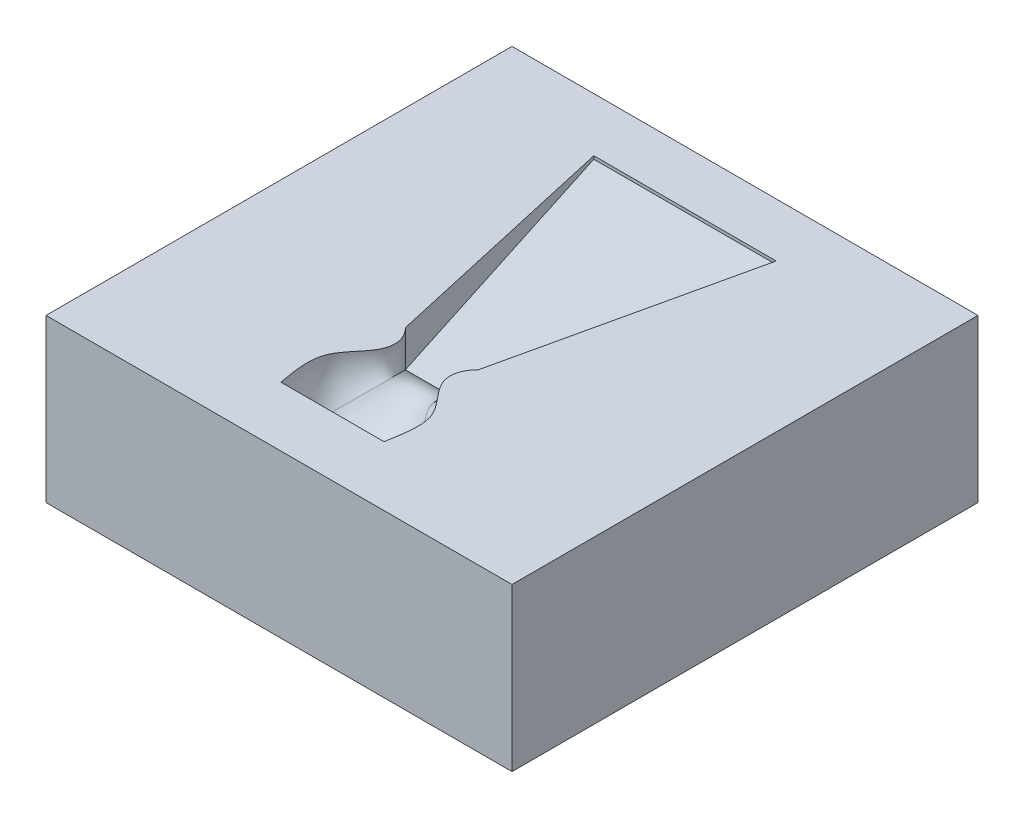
ISO-10303-21;
HEADER;
FILE_DESCRIPTION(('STEP AP214'),'2;1');
FILE_NAME('part.step','',(''),(''),'','','');
FILE_SCHEMA(('AUTOMOTIVE_DESIGN { 1 0 10303 214 1 1 1 1 }'));
ENDSEC;
DATA;
#1=APPLICATION_CONTEXT('core data for automotive mechanical design processes');
#2=APPLICATION_PROTOCOL_DEFINITION('international standard','automotive_design',2000,#1);
#3=PRODUCT_CONTEXT('',#1,'mechanical');
#4=PRODUCT('Part','Part','',(#3));
#5=PRODUCT_RELATED_PRODUCT_CATEGORY('part','',(#4));
#6=PRODUCT_DEFINITION_FORMATION('','',#4);
#7=PRODUCT_DEFINITION_CONTEXT('part definition',#1,'design');
#8=PRODUCT_DEFINITION('design','',#6,#7);
#9=PRODUCT_DEFINITION_SHAPE('','',#8);
#10=(LENGTH_UNIT() NAMED_UNIT(*) SI_UNIT(.MILLI.,.METRE.));
#11=(NAMED_UNIT(*) PLANE_ANGLE_UNIT() SI_UNIT($,.RADIAN.));
#12=(NAMED_UNIT(*) SI_UNIT($,.STERADIAN.) SOLID_ANGLE_UNIT());
#13=UNCERTAINTY_MEASURE_WITH_UNIT(LENGTH_MEASURE(1.E-05),#10,'distance_accuracy_value','');
#14=(GEOMETRIC_REPRESENTATION_CONTEXT(3) GLOBAL_UNCERTAINTY_ASSIGNED_CONTEXT((#13)) GLOBAL_UNIT_ASSIGNED_CONTEXT((#10,
#11,#12)) REPRESENTATION_CONTEXT('',''));
#15=CARTESIAN_POINT('',(0.,0.,0.));
#16=DIRECTION('',(0.,0.,1.));
#17=DIRECTION('',(1.,0.,0.));
#18=AXIS2_PLACEMENT_3D('',#15,#16,#17);
#19=CARTESIAN_POINT('',(0.,40.,0.));
#20=DIRECTION('',(-1.,0.,0.));
#21=DIRECTION('',(0.,0.,1.));
#22=AXIS2_PLACEMENT_3D('',#19,#20,#21);
#23=PLANE('',#22);
#24=DIRECTION('',(0.,0.,-1.));
#25=VECTOR('',#24,1.);
#26=CARTESIAN_POINT('',(0.,0.,0.));
#27=LINE('',#26,#25);
#28=CARTESIAN_POINT('',(0.,0.,0.));
#29=VERTEX_POINT('',#28);
#30=CARTESIAN_POINT('',(0.,0.,-115.));
#31=VERTEX_POINT('',#30);
#32=EDGE_CURVE('E321',#29,#31,#27,.T.);
#33=ORIENTED_EDGE('',*,*,#32,.T.);
#34=DIRECTION('',(0.,-1.,0.));
#35=VECTOR('',#34,1.);
#36=CARTESIAN_POINT('',(0.,40.,-115.));
#37=LINE('',#36,#35);
#38=CARTESIAN_POINT('',(0.,40.,-115.));
#39=VERTEX_POINT('',#38);
#40=EDGE_CURVE('E368',#39,#31,#37,.T.);
#41=ORIENTED_EDGE('',*,*,#40,.F.);
#42=DIRECTION('',(0.,0.,-1.));
#43=VECTOR('',#42,1.);
#44=CARTESIAN_POINT('',(0.,40.,0.));
#45=LINE('',#44,#43);
#46=CARTESIAN_POINT('',(0.,40.,0.));
#47=VERTEX_POINT('',#46);
#48=EDGE_CURVE('E348',#47,#39,#45,.T.);
#49=ORIENTED_EDGE('',*,*,#48,.F.);
#50=DIRECTION('',(0.,-1.,0.));
#51=VECTOR('',#50,1.);
#52=CARTESIAN_POINT('',(0.,40.,0.));
#53=LINE('',#52,#51);
#54=EDGE_CURVE('E354',#47,#29,#53,.T.);
#55=ORIENTED_EDGE('',*,*,#54,.T.);
#56=EDGE_LOOP('',(#33,#41,#49,#55));
#57=FACE_BOUND('',#56,.T.);
#58=ADVANCED_FACE('F37',(#57),#23,.F.);
#59=CARTESIAN_POINT('',(0.,40.,-115.));
#60=DIRECTION('',(0.,0.,1.));
#61=DIRECTION('',(1.,0.,0.));
#62=AXIS2_PLACEMENT_3D('',#59,#60,#61);
#63=PLANE('',#62);
#64=DIRECTION('',(-1.,0.,0.));
#65=VECTOR('',#64,1.);
#66=CARTESIAN_POINT('',(0.,0.,-115.));
#67=LINE('',#66,#65);
#68=CARTESIAN_POINT('',(-115.,0.,-115.));
#69=VERTEX_POINT('',#68);
#70=EDGE_CURVE('E357',#31,#69,#67,.T.);
#71=ORIENTED_EDGE('',*,*,#70,.T.);
#72=DIRECTION('',(0.,-1.,0.));
#73=VECTOR('',#72,1.);
#74=CARTESIAN_POINT('',(-115.,40.,-115.));
#75=LINE('',#74,#73);
#76=CARTESIAN_POINT('',(-115.,40.,-115.));
#77=VERTEX_POINT('',#76);
#78=EDGE_CURVE('E365',#77,#69,#75,.T.);
#79=ORIENTED_EDGE('',*,*,#78,.F.);
#80=DIRECTION('',(-1.,0.,0.));
#81=VECTOR('',#80,1.);
#82=CARTESIAN_POINT('',(0.,40.,-115.));
#83=LINE('',#82,#81);
#84=EDGE_CURVE('E93',#39,#77,#83,.T.);
#85=ORIENTED_EDGE('',*,*,#84,.F.);
#86=ORIENTED_EDGE('',*,*,#40,.T.);
#87=EDGE_LOOP('',(#71,#79,#85,#86));
#88=FACE_BOUND('',#87,.T.);
#89=ADVANCED_FACE('F404',(#88),#63,.F.);
#90=CARTESIAN_POINT('',(-115.,40.,0.));
#91=DIRECTION('',(1.,0.,0.));
#92=DIRECTION('',(0.,0.,-1.));
#93=AXIS2_PLACEMENT_3D('',#90,#91,#92);
#94=PLANE('',#93);
#95=DIRECTION('',(0.,0.,1.));
#96=VECTOR('',#95,1.);
#97=CARTESIAN_POINT('',(-115.,0.,0.));
#98=LINE('',#97,#96);
#99=CARTESIAN_POINT('',(-115.,0.,0.));
#100=VERTEX_POINT('',#99);
#101=EDGE_CURVE('E359',#69,#100,#98,.T.);
#102=ORIENTED_EDGE('',*,*,#101,.T.);
#103=DIRECTION('',(0.,-1.,0.));
#104=VECTOR('',#103,1.);
#105=CARTESIAN_POINT('',(-115.,40.,0.));
#106=LINE('',#105,#104);
#107=CARTESIAN_POINT('',(-115.,40.,0.));
#108=VERTEX_POINT('',#107);
#109=EDGE_CURVE('E363',#108,#100,#106,.T.);
#110=ORIENTED_EDGE('',*,*,#109,.F.);
#111=DIRECTION('',(0.,0.,1.));
#112=VECTOR('',#111,1.);
#113=CARTESIAN_POINT('',(-115.,40.,0.));
#114=LINE('',#113,#112);
#115=EDGE_CURVE('E351',#77,#108,#114,.T.);
#116=ORIENTED_EDGE('',*,*,#115,.F.);
#117=ORIENTED_EDGE('',*,*,#78,.T.);
#118=EDGE_LOOP('',(#102,#110,#116,#117));
#119=FACE_BOUND('',#118,.T.);
#120=ADVANCED_FACE('F409',(#119),#94,.F.);
#121=CARTESIAN_POINT('',(0.,40.,0.));
#122=DIRECTION('',(0.,0.,-1.));
#123=DIRECTION('',(-1.,0.,0.));
#124=AXIS2_PLACEMENT_3D('',#121,#122,#123);
#125=PLANE('',#124);
#126=DIRECTION('',(1.,0.,0.));
#127=VECTOR('',#126,1.);
#128=CARTESIAN_POINT('',(0.,0.,0.));
#129=LINE('',#128,#127);
#130=EDGE_CURVE('E85',#100,#29,#129,.T.);
#131=ORIENTED_EDGE('',*,*,#130,.T.);
#132=ORIENTED_EDGE('',*,*,#54,.F.);
#133=DIRECTION('',(1.,0.,0.));
#134=VECTOR('',#133,1.);
#135=CARTESIAN_POINT('',(0.,40.,0.));
#136=LINE('',#135,#134);
#137=EDGE_CURVE('E64',#108,#47,#136,.T.);
#138=ORIENTED_EDGE('',*,*,#137,.F.);
#139=ORIENTED_EDGE('',*,*,#109,.T.);
#140=EDGE_LOOP('',(#131,#132,#138,#139));
#141=FACE_BOUND('',#140,.T.);
#142=ADVANCED_FACE('F280',(#141),#125,.F.);
#143=CARTESIAN_POINT('',(0.,40.,0.));
#144=DIRECTION('',(0.,1.,0.));
#145=DIRECTION('',(0.,0.,1.));
#146=AXIS2_PLACEMENT_3D('',#143,#144,#145);
#147=PLANE('',#146);
#148=CARTESIAN_POINT('',(-46.3077188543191,40.,-14.7259999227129));
#149=CARTESIAN_POINT('',(-46.2579454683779,40.,-15.0263227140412));
#150=CARTESIAN_POINT('',(-46.2070289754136,40.,-15.3264509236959));
#151=CARTESIAN_POINT('',(-46.1047439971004,40.,-15.926660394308));
#152=CARTESIAN_POINT('',(-46.0533754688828,40.,-16.226741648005));
#153=CARTESIAN_POINT('',(-45.9517613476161,40.,-16.8287388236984));
#154=CARTESIAN_POINT('',(-45.9015231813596,40.,-17.1306560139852));
#155=CARTESIAN_POINT('',(-45.8044134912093,40.,-17.7350280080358));
#156=CARTESIAN_POINT('',(-45.757541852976,40.,-18.0374827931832));
#157=CARTESIAN_POINT('',(-45.6663746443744,40.,-18.6629974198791));
#158=CARTESIAN_POINT('',(-45.6224476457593,40.,-18.9861120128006));
#159=CARTESIAN_POINT('',(-45.5435842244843,40.,-19.633495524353));
#160=CARTESIAN_POINT('',(-45.5086486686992,40.,-19.9577645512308));
#161=CARTESIAN_POINT('',(-45.450990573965,40.,-20.6066894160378));
#162=CARTESIAN_POINT('',(-45.4282406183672,40.,-20.9313427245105));
#163=CARTESIAN_POINT('',(-45.398388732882,40.,-21.58133422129));
#164=CARTESIAN_POINT('',(-45.3912823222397,40.,-21.9066721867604));
#165=CARTESIAN_POINT('',(-45.3968523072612,40.,-22.5792996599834));
#166=CARTESIAN_POINT('',(-45.4109010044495,40.,-22.9265837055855));
#167=CARTESIAN_POINT('',(-45.4666142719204,40.,-23.6193380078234));
#168=CARTESIAN_POINT('',(-45.5082938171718,40.,-23.9648071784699));
#169=CARTESIAN_POINT('',(-45.5947321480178,40.,-24.4752091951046));
#170=CARTESIAN_POINT('',(-45.6270606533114,40.,-24.6422873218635));
#171=CARTESIAN_POINT('',(-45.7000810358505,40.,-24.9746308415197));
#172=CARTESIAN_POINT('',(-45.7407731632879,40.,-25.1398961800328));
#173=CARTESIAN_POINT('',(-45.8309049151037,40.,-25.4678242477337));
#174=CARTESIAN_POINT('',(-45.8803342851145,40.,-25.6304897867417));
#175=CARTESIAN_POINT('',(-45.9882734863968,40.,-25.9527704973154));
#176=CARTESIAN_POINT('',(-46.0467824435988,40.,-26.1123859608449));
#177=CARTESIAN_POINT('',(-46.1734201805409,40.,-26.4288415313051));
#178=CARTESIAN_POINT('',(-46.2416028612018,40.,-26.5856601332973));
#179=CARTESIAN_POINT('',(-46.3872631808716,40.,-26.8949139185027));
#180=CARTESIAN_POINT('',(-46.4647412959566,40.,-27.0473488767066));
#181=CARTESIAN_POINT('',(-46.6274768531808,40.,-27.3481835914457));
#182=CARTESIAN_POINT('',(-46.7127424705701,40.,-27.4965788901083));
#183=CARTESIAN_POINT('',(-46.889603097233,40.,-27.7895389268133));
#184=CARTESIAN_POINT('',(-46.9811984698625,40.,-27.9341034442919));
#185=CARTESIAN_POINT('',(-47.1705624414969,40.,-28.2214970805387));
#186=CARTESIAN_POINT('',(-47.2683897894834,40.,-28.3642872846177));
#187=CARTESIAN_POINT('',(-47.46814804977,40.,-28.6469477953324));
#188=CARTESIAN_POINT('',(-47.5700788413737,40.,-28.7868181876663));
#189=CARTESIAN_POINT('',(-47.8804721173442,40.,-29.2028065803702));
#190=CARTESIAN_POINT('',(-48.093613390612,40.,-29.4754166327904));
#191=CARTESIAN_POINT('',(-48.5030992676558,40.,-29.9875497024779));
#192=CARTESIAN_POINT('',(-48.6988638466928,40.,-30.2275466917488));
#193=CARTESIAN_POINT('',(-49.0909647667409,40.,-30.7070985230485));
#194=CARTESIAN_POINT('',(-49.2873011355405,40.,-30.9466533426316));
#195=CARTESIAN_POINT('',(-49.6757180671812,40.,-31.4279361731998));
#196=CARTESIAN_POINT('',(-49.8678103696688,40.,-31.6696546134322));
#197=CARTESIAN_POINT('',(-50.243702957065,40.,-32.1595077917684));
#198=CARTESIAN_POINT('',(-50.427504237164,40.,-32.4076417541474));
#199=CARTESIAN_POINT('',(-50.7394500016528,40.,-32.8545075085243));
#200=CARTESIAN_POINT('',(-50.8705309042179,40.,-33.0511620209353));
#201=CARTESIAN_POINT('',(-51.0583491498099,40.,-33.3516650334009));
#202=CARTESIAN_POINT('',(-51.1194922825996,40.,-33.4527606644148));
#203=CARTESIAN_POINT('',(-51.2383377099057,40.,-33.6569609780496));
#204=CARTESIAN_POINT('',(-51.2960400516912,40.,-33.7600656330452));
#205=CARTESIAN_POINT('',(-51.4073435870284,40.,-33.9682066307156));
#206=CARTESIAN_POINT('',(-51.4609528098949,40.,-34.0732386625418));
#207=CARTESIAN_POINT('',(-51.5635738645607,40.,-34.2855340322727));
#208=CARTESIAN_POINT('',(-51.6125856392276,40.,-34.3927973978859));
#209=CARTESIAN_POINT('',(-51.7055870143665,40.,-34.6094414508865));
#210=CARTESIAN_POINT('',(-51.749578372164,40.,-34.7188213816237));
#211=CARTESIAN_POINT('',(-51.8321719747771,40.,-34.9395869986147));
#212=CARTESIAN_POINT('',(-51.8707746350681,40.,-35.0509725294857));
#213=CARTESIAN_POINT('',(-51.9570252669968,40.,-35.3222271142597));
#214=CARTESIAN_POINT('',(-52.0017775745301,40.,-35.4830313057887));
#215=CARTESIAN_POINT('',(-52.078596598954,40.,-35.8076401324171));
#216=CARTESIAN_POINT('',(-52.1106644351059,40.,-35.9714445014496));
#217=CARTESIAN_POINT('',(-52.1611387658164,40.,-36.3011562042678));
#218=CARTESIAN_POINT('',(-52.1795461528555,40.,-36.4670633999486));
#219=CARTESIAN_POINT('',(-52.2019428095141,40.,-36.7998597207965));
#220=CARTESIAN_POINT('',(-52.2059323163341,40.,-36.9667488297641));
#221=CARTESIAN_POINT('',(-52.1990517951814,40.,-37.3008582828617));
#222=CARTESIAN_POINT('',(-52.1881257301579,40.,-37.4680775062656));
#223=CARTESIAN_POINT('',(-52.1512911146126,40.,-37.8008542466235));
#224=CARTESIAN_POINT('',(-52.1253826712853,40.,-37.9664117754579));
#225=CARTESIAN_POINT('',(-52.0589777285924,40.,-38.2946073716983));
#226=CARTESIAN_POINT('',(-52.0184777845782,40.,-38.4572447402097));
#227=CARTESIAN_POINT('',(-51.9236772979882,40.,-38.7784334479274));
#228=CARTESIAN_POINT('',(-51.8693755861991,40.,-38.9369844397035));
#229=CARTESIAN_POINT('',(-51.7367573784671,40.,-39.278089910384));
#230=CARTESIAN_POINT('',(-51.6558546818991,40.,-39.4596413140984));
#231=CARTESIAN_POINT('',(-51.4781994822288,40.,-39.8147660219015));
#232=CARTESIAN_POINT('',(-51.3814423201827,40.,-39.9883369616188));
#233=CARTESIAN_POINT('',(-51.0702677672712,40.,-40.4967967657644));
#234=CARTESIAN_POINT('',(-50.8350550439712,40.,-40.8191688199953));
#235=CARTESIAN_POINT('',(-50.4932171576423,40.,-41.2286754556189));
#236=CARTESIAN_POINT('',(-50.4038224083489,40.,-41.3310183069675));
#237=CARTESIAN_POINT('',(-50.2212751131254,40.,-41.531480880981));
#238=CARTESIAN_POINT('',(-50.1281407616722,40.,-41.6296171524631));
#239=CARTESIAN_POINT('',(-50.0331451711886,40.,-41.7259999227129));
#240=B_SPLINE_CURVE_WITH_KNOTS('',3,(#148,#149,#150,#151,#152,#153,#154,#155,#156,#157,#158,
#159,#160,#161,#162,#163,#164,#165,#166,#167,#168,#169,#170,#171,#172,#173,#174,#175,#176,#177,
#178,#179,#180,#181,#182,#183,#184,#185,#186,#187,#188,#189,#190,#191,#192,#193,#194,#195,#196,
#197,#198,#199,#200,#201,#202,#203,#204,#205,#206,#207,#208,#209,#210,#211,#212,#213,#214,#215,
#216,#217,#218,#219,#220,#221,#222,#223,#224,#225,#226,#227,#228,#229,#230,#231,#232,#233,#234,
#235,#236,#237,#238,#239),.UNSPECIFIED.,.F.,.F.,(4,2,2,2,2,2,2,2,2,2,2,2,2,2,2,2,2,2,2,2,2,2,2,
2,2,2,2,2,2,2,2,2,2,2,2,2,2,2,2,2,2,2,2,2,2,4),(0.,0.913250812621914,1.82658918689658,
2.74478593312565,3.66295147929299,4.6411249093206,5.61939261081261,6.5954499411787,
7.5712276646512,8.61308599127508,9.65550943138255,10.1658622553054,10.676230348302,
11.1860033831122,11.6957273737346,12.2084119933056,12.721122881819,13.2343783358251,
13.747663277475,14.2668346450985,14.7859907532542,15.8238871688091,16.7530352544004,
17.6822292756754,18.6084090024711,19.5344772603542,20.2431457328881,20.597532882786,
20.9519151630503,21.3055833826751,21.6592559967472,22.0128044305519,22.3663255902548,
22.8665753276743,23.366780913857,23.8669538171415,24.3671184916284,24.8691674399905,
25.3712127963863,25.873376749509,26.3755832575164,26.9709482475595,27.5664885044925,
28.7584133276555,29.1660358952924,29.5718712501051),.UNSPECIFIED.);
#241=CARTESIAN_POINT('',(-46.3064709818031,39.9999999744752,-14.7259999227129));
#242=VERTEX_POINT('',#241);
#243=CARTESIAN_POINT('',(-50.0331451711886,40.,-41.7259999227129));
#244=VERTEX_POINT('',#243);
#245=EDGE_CURVE('E11',#242,#244,#240,.T.);
#246=ORIENTED_EDGE('',*,*,#245,.F.);
#247=DIRECTION('',(1.,0.,0.));
#248=VECTOR('',#247,1.);
#249=CARTESIAN_POINT('',(0.,40.,-14.7259999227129));
#250=LINE('',#249,#248);
#251=CARTESIAN_POINT('',(-71.7598193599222,40.0000000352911,-14.7259999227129));
#252=VERTEX_POINT('',#251);
#253=EDGE_CURVE('E273',#252,#242,#250,.T.);
#254=ORIENTED_EDGE('',*,*,#253,.F.);
#255=CARTESIAN_POINT('',(-68.0331451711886,40.,-41.7259999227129));
#256=CARTESIAN_POINT('',(-67.9173955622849,40.,-41.608570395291));
#257=CARTESIAN_POINT('',(-67.8043301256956,40.,-41.4884321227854));
#258=CARTESIAN_POINT('',(-67.5840417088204,40.,-41.2420518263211));
#259=CARTESIAN_POINT('',(-67.4768440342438,40.,-41.1157872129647));
#260=CARTESIAN_POINT('',(-67.2695722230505,40.,-40.8572361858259));
#261=CARTESIAN_POINT('',(-67.1695077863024,40.,-40.7249419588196));
#262=CARTESIAN_POINT('',(-66.9769628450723,40.,-40.453308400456));
#263=CARTESIAN_POINT('',(-66.884550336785,40.,-40.3139206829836));
#264=CARTESIAN_POINT('',(-66.7095329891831,40.,-40.0293347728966));
#265=CARTESIAN_POINT('',(-66.6269159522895,40.,-39.884144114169));
#266=CARTESIAN_POINT('',(-66.4726815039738,40.,-39.588170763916));
#267=CARTESIAN_POINT('',(-66.4010543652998,40.,-39.4373931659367));
#268=CARTESIAN_POINT('',(-66.2716770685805,40.,-39.1346496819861));
#269=CARTESIAN_POINT('',(-66.2136119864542,40.,-38.9828188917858));
#270=CARTESIAN_POINT('',(-66.1100520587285,40.,-38.6749051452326));
#271=CARTESIAN_POINT('',(-66.0645575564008,40.,-38.5188220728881));
#272=CARTESIAN_POINT('',(-65.9871630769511,40.,-38.2040621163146));
#273=CARTESIAN_POINT('',(-65.9552022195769,40.,-38.045400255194));
#274=CARTESIAN_POINT('',(-65.9051161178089,40.,-37.7259052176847));
#275=CARTESIAN_POINT('',(-65.8869906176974,40.,-37.5650720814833));
#276=CARTESIAN_POINT('',(-65.8647341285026,40.,-37.2421266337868));
#277=CARTESIAN_POINT('',(-65.8606305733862,40.,-37.0800124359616));
#278=CARTESIAN_POINT('',(-65.8663013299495,40.,-36.756039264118));
#279=CARTESIAN_POINT('',(-65.8760755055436,40.,-36.5941802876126));
#280=CARTESIAN_POINT('',(-65.9090001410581,40.,-36.2715748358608));
#281=CARTESIAN_POINT('',(-65.9321724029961,40.,-36.110830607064));
#282=CARTESIAN_POINT('',(-65.9911204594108,40.,-35.7916582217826));
#283=CARTESIAN_POINT('',(-66.0268992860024,40.,-35.633230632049));
#284=CARTESIAN_POINT('',(-66.1240715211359,40.,-35.2668667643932));
#285=CARTESIAN_POINT('',(-66.1900308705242,40.,-35.0601362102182));
#286=CARTESIAN_POINT('',(-66.3402751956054,40.,-34.6534732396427));
#287=CARTESIAN_POINT('',(-66.4245644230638,40.,-34.4535424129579));
#288=CARTESIAN_POINT('',(-66.6091268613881,40.,-34.0611641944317));
#289=CARTESIAN_POINT('',(-66.7094073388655,40.,-33.8687202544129));
#290=CARTESIAN_POINT('',(-66.9222652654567,40.,-33.4908300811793));
#291=CARTESIAN_POINT('',(-67.034843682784,40.,-33.3053844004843));
#292=CARTESIAN_POINT('',(-67.2426166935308,40.,-32.9818486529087));
#293=CARTESIAN_POINT('',(-67.3359628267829,40.,-32.8425576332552));
#294=CARTESIAN_POINT('',(-67.5269936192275,40.,-32.5669737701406));
#295=CARTESIAN_POINT('',(-67.6246786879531,40.,-32.4306812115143));
#296=CARTESIAN_POINT('',(-67.922705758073,40.,-32.0254047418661));
#297=CARTESIAN_POINT('',(-68.1279866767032,40.,-31.7600717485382));
#298=CARTESIAN_POINT('',(-68.5463810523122,40.,-31.2328966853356));
#299=CARTESIAN_POINT('',(-68.7595374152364,40.,-30.9710894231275));
#300=CARTESIAN_POINT('',(-69.1868699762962,40.,-30.448240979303));
#301=CARTESIAN_POINT('',(-69.4010463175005,40.,-30.1871999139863));
#302=CARTESIAN_POINT('',(-69.7506947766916,40.,-29.7537340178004));
#303=CARTESIAN_POINT('',(-69.887428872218,40.,-29.5823343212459));
#304=CARTESIAN_POINT('',(-70.1574865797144,40.,-29.2368610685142));
#305=CARTESIAN_POINT('',(-70.2908102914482,40.,-29.0627875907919));
#306=CARTESIAN_POINT('',(-70.5522630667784,40.,-28.710838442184));
#307=CARTESIAN_POINT('',(-70.6803937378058,40.,-28.5329639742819));
#308=CARTESIAN_POINT('',(-70.9295107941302,40.,-28.1721670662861));
#309=CARTESIAN_POINT('',(-71.0504949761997,40.,-27.9892430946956));
#310=CARTESIAN_POINT('',(-71.281045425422,40.,-27.6202546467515));
#311=CARTESIAN_POINT('',(-71.3907614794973,40.,-27.4342849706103));
#312=CARTESIAN_POINT('',(-71.5463084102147,40.,-27.1503776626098));
#313=CARTESIAN_POINT('',(-71.5966565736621,40.,-27.0549084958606));
#314=CARTESIAN_POINT('',(-71.6939439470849,40.,-26.862251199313));
#315=CARTESIAN_POINT('',(-71.7408832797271,40.,-26.765063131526));
#316=CARTESIAN_POINT('',(-71.8760113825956,40.,-26.471079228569));
#317=CARTESIAN_POINT('',(-71.9586122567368,40.,-26.2716800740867));
#318=CARTESIAN_POINT('',(-72.1089411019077,40.,-25.8675557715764));
#319=CARTESIAN_POINT('',(-72.1766789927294,40.,-25.6628342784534));
#320=CARTESIAN_POINT('',(-72.3070957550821,40.,-25.2176286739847));
#321=CARTESIAN_POINT('',(-72.3674240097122,40.,-24.9764557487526));
#322=CARTESIAN_POINT('',(-72.4704506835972,40.,-24.4901270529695));
#323=CARTESIAN_POINT('',(-72.5131277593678,40.,-24.2449668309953));
#324=CARTESIAN_POINT('',(-72.5824968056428,40.,-23.7523392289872));
#325=CARTESIAN_POINT('',(-72.6091825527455,40.,-23.5048709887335));
#326=CARTESIAN_POINT('',(-72.6489332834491,40.,-23.0027708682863));
#327=CARTESIAN_POINT('',(-72.661648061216,40.,-22.7481121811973));
#328=CARTESIAN_POINT('',(-72.6743413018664,40.,-22.2386784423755));
#329=CARTESIAN_POINT('',(-72.6743280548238,40.,-21.9839035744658));
#330=CARTESIAN_POINT('',(-72.6635600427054,40.,-21.4746622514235));
#331=CARTESIAN_POINT('',(-72.6528075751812,40.,-21.2201957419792));
#332=CARTESIAN_POINT('',(-72.6214779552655,40.,-20.6965772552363));
#333=CARTESIAN_POINT('',(-72.6003505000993,40.,-20.4274593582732));
#334=CARTESIAN_POINT('',(-72.550052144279,40.,-19.8899515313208));
#335=CARTESIAN_POINT('',(-72.520879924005,40.,-19.6215617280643));
#336=CARTESIAN_POINT('',(-72.4562549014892,40.,-19.0854050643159));
#337=CARTESIAN_POINT('',(-72.4207987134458,40.,-18.8176386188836));
#338=CARTESIAN_POINT('',(-72.3452127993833,40.,-18.2826459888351));
#339=CARTESIAN_POINT('',(-72.305080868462,40.,-18.0154201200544));
#340=CARTESIAN_POINT('',(-72.2238833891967,40.,-17.4958398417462));
#341=CARTESIAN_POINT('',(-72.1829843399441,40.,-17.2434591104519));
#342=CARTESIAN_POINT('',(-72.0995277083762,40.,-16.7390768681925));
#343=CARTESIAN_POINT('',(-72.0569707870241,40.,-16.4870752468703));
#344=CARTESIAN_POINT('',(-71.9713427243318,40.,-15.9834208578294));
#345=CARTESIAN_POINT('',(-71.9282721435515,40.,-15.7317679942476));
#346=CARTESIAN_POINT('',(-71.8427258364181,40.,-15.2287885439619));
#347=CARTESIAN_POINT('',(-71.80024924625,40.,-14.9774621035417));
#348=CARTESIAN_POINT('',(-71.7585714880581,40.,-14.7259999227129));
#349=B_SPLINE_CURVE_WITH_KNOTS('',3,(#255,#256,#257,#258,#259,#260,#261,#262,#263,#264,#265,
#266,#267,#268,#269,#270,#271,#272,#273,#274,#275,#276,#277,#278,#279,#280,#281,#282,#283,#284,
#285,#286,#287,#288,#289,#290,#291,#292,#293,#294,#295,#296,#297,#298,#299,#300,#301,#302,#303,
#304,#305,#306,#307,#308,#309,#310,#311,#312,#313,#314,#315,#316,#317,#318,#319,#320,#321,#322,
#323,#324,#325,#326,#327,#328,#329,#330,#331,#332,#333,#334,#335,#336,#337,#338,#339,#340,#341,
#342,#343,#344,#345,#346,#347,#348),.UNSPECIFIED.,.F.,.F.,(4,2,2,2,2,2,2,2,2,2,2,2,2,2,2,2,2,2,
2,2,2,2,2,2,2,2,2,2,2,2,2,2,2,2,2,2,2,2,2,2,2,2,2,2,2,2,4),(0.,0.494683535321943,
0.991355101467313,1.48868965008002,1.99005266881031,2.49078467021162,2.99107088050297,
3.47822413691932,3.96539069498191,4.45034186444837,4.93528407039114,5.42117452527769,
5.90706021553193,6.39373879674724,6.88053451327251,7.53050642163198,8.18062925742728,
8.83104836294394,9.48151871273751,9.98445706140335,10.4874429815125,11.4935934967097,
12.5064147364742,13.5193824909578,14.17713162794,14.8348615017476,15.4923862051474,
16.1501125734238,16.7974826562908,17.121220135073,17.4449459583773,18.0917691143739,
18.7381592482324,19.4832190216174,20.2291770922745,20.97542528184,21.7399804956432,
22.5040377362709,23.2679315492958,24.0776169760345,24.8874352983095,25.6976912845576,
26.5083309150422,27.2753410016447,28.0420483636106,28.8079841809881,29.5726569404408),.UNSPECIFIED.);
#350=CARTESIAN_POINT('',(-68.0331451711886,40.,-41.7259999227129));
#351=VERTEX_POINT('',#350);
#352=EDGE_CURVE('E271',#351,#252,#349,.T.);
#353=ORIENTED_EDGE('',*,*,#352,.F.);
#354=DIRECTION('',(-0.219512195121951,0.,-0.975609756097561));
#355=VECTOR('',#354,1.);
#356=CARTESIAN_POINT('',(-55.8189603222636,40.,12.5592660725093));
#357=LINE('',#356,#355);
#358=CARTESIAN_POINT('',(-81.5331451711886,40.,-101.725999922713));
#359=VERTEX_POINT('',#358);
#360=EDGE_CURVE('E370',#351,#359,#357,.T.);
#361=ORIENTED_EDGE('',*,*,#360,.T.);
#362=DIRECTION('',(1.,0.,0.));
#363=VECTOR('',#362,1.);
#364=CARTESIAN_POINT('',(0.,40.,-101.725999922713));
#365=LINE('',#364,#363);
#366=CARTESIAN_POINT('',(-36.5331451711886,40.,-101.725999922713));
#367=VERTEX_POINT('',#366);
#368=EDGE_CURVE('E373',#359,#367,#365,.T.);
#369=ORIENTED_EDGE('',*,*,#368,.T.);
#370=DIRECTION('',(-0.219512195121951,0.,0.975609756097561));
#371=VECTOR('',#370,1.);
#372=CARTESIAN_POINT('',(-56.5582345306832,40.,-12.7256027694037));
#373=LINE('',#372,#371);
#374=EDGE_CURVE('E46',#367,#244,#373,.T.);
#375=ORIENTED_EDGE('',*,*,#374,.T.);
#376=EDGE_LOOP('',(#246,#254,#353,#361,#369,#375));
#377=FACE_BOUND('',#376,.T.);
#378=ORIENTED_EDGE('',*,*,#48,.T.);
#379=ORIENTED_EDGE('',*,*,#84,.T.);
#380=ORIENTED_EDGE('',*,*,#115,.T.);
#381=ORIENTED_EDGE('',*,*,#137,.T.);
#382=EDGE_LOOP('',(#378,#379,#380,#381));
#383=FACE_BOUND('',#382,.T.);
#384=ADVANCED_FACE('F275',(#377,#383),#147,.T.);
#385=CARTESIAN_POINT('',(0.,0.,0.));
#386=DIRECTION('',(0.,1.,0.));
#387=DIRECTION('',(0.,0.,1.));
#388=AXIS2_PLACEMENT_3D('',#385,#386,#387);
#389=PLANE('',#388);
#390=ORIENTED_EDGE('',*,*,#32,.F.);
#391=ORIENTED_EDGE('',*,*,#130,.F.);
#392=ORIENTED_EDGE('',*,*,#101,.F.);
#393=ORIENTED_EDGE('',*,*,#70,.F.);
#394=EDGE_LOOP('',(#390,#391,#392,#393));
#395=FACE_BOUND('',#394,.T.);
#396=ADVANCED_FACE('F279',(#395),#389,.F.);
#397=CARTESIAN_POINT('',(-59.0331451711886,39.999946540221,-14.7259999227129));
#398=DIRECTION('',(0.,0.,1.));
#399=DIRECTION('',(1.,0.,0.));
#400=AXIS2_PLACEMENT_3D('',#397,#398,#399);
#401=PLANE('',#400);
#402=ORIENTED_EDGE('',*,*,#253,.T.);
#403=CARTESIAN_POINT('',(-59.0331451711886,39.999946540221,-14.7259999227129));
#404=DIRECTION('',(0.,0.,1.));
#405=DIRECTION('',(1.,0.,0.));
#406=AXIS2_PLACEMENT_3D('',#403,#404,#405);
#407=CIRCLE('',#406,12.7279220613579);
#408=CARTESIAN_POINT('',(-50.0331451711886,30.999946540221,-14.7259999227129));
#409=VERTEX_POINT('',#408);
#410=EDGE_CURVE('E212',#409,#242,#407,.T.);
#411=ORIENTED_EDGE('',*,*,#410,.F.);
#412=CARTESIAN_POINT('',(-68.0331451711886,30.999946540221,-14.7259999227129));
#413=VERTEX_POINT('',#412);
#414=EDGE_CURVE('E319',#413,#409,#407,.T.);
#415=ORIENTED_EDGE('',*,*,#414,.F.);
#416=EDGE_CURVE('E206',#252,#413,#407,.T.);
#417=ORIENTED_EDGE('',*,*,#416,.F.);
#418=EDGE_LOOP('',(#402,#411,#415,#417));
#419=FACE_BOUND('',#418,.T.);
#420=ADVANCED_FACE('F254',(#419),#401,.F.);
#421=CARTESIAN_POINT('',(-50.0331451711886,30.999946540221,-41.7259999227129));
#422=CARTESIAN_POINT('',(-52.4976112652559,33.4644126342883,-39.2259999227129));
#423=CARTESIAN_POINT('',(-55.5987213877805,36.5655227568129,-33.7207224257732));
#424=CARTESIAN_POINT('',(-48.056823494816,29.0236248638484,-26.4389757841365));
#425=CARTESIAN_POINT('',(-49.3256970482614,30.2924984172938,-18.9942279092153));
#426=CARTESIAN_POINT('',(-50.0331451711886,30.999946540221,-14.7259999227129));
#427=CARTESIAN_POINT('',(-50.0331451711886,36.999946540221,-41.7259999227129));
#428=CARTESIAN_POINT('',(-52.4976112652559,37.8214352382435,-39.2259999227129));
#429=CARTESIAN_POINT('',(-51.9140465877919,38.089037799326,-33.7207224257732));
#430=CARTESIAN_POINT('',(-42.5818156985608,35.2028339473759,-26.4389757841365));
#431=CARTESIAN_POINT('',(-44.3584619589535,35.7313655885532,-18.9942279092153));
#432=CARTESIAN_POINT('',(-45.0659100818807,35.9671816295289,-14.7259999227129));
#433=CARTESIAN_POINT('',(-50.0331451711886,42.999946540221,-41.7259999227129));
#434=CARTESIAN_POINT('',(-52.4976112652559,42.1784578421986,-39.2259999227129));
#435=CARTESIAN_POINT('',(-51.9140465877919,41.9108552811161,-33.7207224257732));
#436=CARTESIAN_POINT('',(-42.5818156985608,44.7970591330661,-26.4389757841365));
#437=CARTESIAN_POINT('',(-44.3584619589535,44.2685274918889,-18.9942279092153));
#438=CARTESIAN_POINT('',(-45.0659100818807,44.0327114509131,-14.7259999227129));
#439=CARTESIAN_POINT('',(-50.0331451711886,48.999946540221,-41.7259999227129));
#440=CARTESIAN_POINT('',(-52.4976112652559,46.5354804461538,-39.2259999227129));
#441=CARTESIAN_POINT('',(-55.5987213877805,43.4343703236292,-33.7207224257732));
#442=CARTESIAN_POINT('',(-48.056823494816,50.9762682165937,-26.4389757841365));
#443=CARTESIAN_POINT('',(-49.3256970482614,49.7073946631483,-18.9942279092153));
#444=CARTESIAN_POINT('',(-50.0331451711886,48.999946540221,-14.7259999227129));
#445=B_SPLINE_SURFACE_WITH_KNOTS('',3,3,((#421,#422,#423,#424,#425,#426),(#427,#428,#429,#430,
#431,#432),(#433,#434,#435,#436,#437,#438),(#439,#440,#441,#442,#443,#444)),.UNSPECIFIED.,.F.,
.F.,.F.,(4,4),(4,1,1,4),(0.,1.),(0.,0.284226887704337,0.593739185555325,1.),.UNSPECIFIED.);
#446=DIRECTION('',(0.,1.,0.));
#447=VECTOR('',#446,1.);
#448=CARTESIAN_POINT('',(-50.0331451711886,48.999946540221,-41.7259999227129));
#449=LINE('',#448,#447);
#450=CARTESIAN_POINT('',(-50.0331451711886,30.999946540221,-41.7259999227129));
#451=VERTEX_POINT('',#450);
#452=EDGE_CURVE('E139',#451,#244,#449,.T.);
#453=CARTESIAN_POINT('',(-50.0331451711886,30.999946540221,-41.7259999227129));
#454=CARTESIAN_POINT('',(-52.4976112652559,33.4644126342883,-39.2259999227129));
#455=CARTESIAN_POINT('',(-55.5987213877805,36.5655227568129,-33.7207224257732));
#456=CARTESIAN_POINT('',(-48.056823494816,29.0236248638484,-26.4389757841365));
#457=CARTESIAN_POINT('',(-49.3256970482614,30.2924984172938,-18.9942279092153));
#458=CARTESIAN_POINT('',(-50.0331451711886,30.999946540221,-14.7259999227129));
#459=B_SPLINE_CURVE_WITH_KNOTS('',3,(#453,#454,#455,#456,#457,#458),.UNSPECIFIED.,.F.,.F.,(4,1,
1,4),(0.,0.284226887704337,0.593739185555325,1.),.UNSPECIFIED.);
#460=EDGE_CURVE('E210',#409,#451,#459,.F.);
#461=ORIENTED_EDGE('',*,*,#245,.T.);
#462=ORIENTED_EDGE('',*,*,#452,.F.);
#463=ORIENTED_EDGE('',*,*,#460,.F.);
#464=ORIENTED_EDGE('',*,*,#410,.T.);
#465=EDGE_LOOP('',(#461,#462,#463,#464));
#466=FACE_BOUND('',#465,.T.);
#467=ADVANCED_FACE('F181',(#466),#445,.F.);
#468=CARTESIAN_POINT('',(-68.0331451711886,30.999946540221,-41.7259999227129));
#469=CARTESIAN_POINT('',(-65.5686790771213,33.4644126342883,-39.2259999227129));
#470=CARTESIAN_POINT('',(-62.4675689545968,36.5655227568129,-33.7207224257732));
#471=CARTESIAN_POINT('',(-70.0094668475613,29.0236248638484,-26.4389757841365));
#472=CARTESIAN_POINT('',(-68.7405932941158,30.2924984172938,-18.9942279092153));
#473=CARTESIAN_POINT('',(-68.0331451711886,30.999946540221,-14.7259999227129));
#474=CARTESIAN_POINT('',(-62.0331451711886,30.999946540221,-41.7259999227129));
#475=CARTESIAN_POINT('',(-61.2116564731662,33.4644126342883,-39.2259999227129));
#476=CARTESIAN_POINT('',(-60.9440539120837,32.8808479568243,-33.7207224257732));
#477=CARTESIAN_POINT('',(-63.8302577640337,23.5486170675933,-26.4389757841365));
#478=CARTESIAN_POINT('',(-63.3017261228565,25.3252633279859,-18.9942279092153));
#479=CARTESIAN_POINT('',(-63.0659100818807,26.0327114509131,-14.7259999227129));
#480=CARTESIAN_POINT('',(-56.0331451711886,30.999946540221,-41.7259999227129));
#481=CARTESIAN_POINT('',(-56.854633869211,33.4644126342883,-39.2259999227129));
#482=CARTESIAN_POINT('',(-57.1222364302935,32.8808479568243,-33.7207224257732));
#483=CARTESIAN_POINT('',(-54.2360325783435,23.5486170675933,-26.4389757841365));
#484=CARTESIAN_POINT('',(-54.7645642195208,25.3252633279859,-18.9942279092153));
#485=CARTESIAN_POINT('',(-55.0003802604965,26.0327114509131,-14.7259999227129));
#486=CARTESIAN_POINT('',(-50.0331451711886,30.999946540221,-41.7259999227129));
#487=CARTESIAN_POINT('',(-52.4976112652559,33.4644126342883,-39.2259999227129));
#488=CARTESIAN_POINT('',(-55.5987213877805,36.5655227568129,-33.7207224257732));
#489=CARTESIAN_POINT('',(-48.056823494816,29.0236248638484,-26.4389757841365));
#490=CARTESIAN_POINT('',(-49.3256970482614,30.2924984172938,-18.9942279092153));
#491=CARTESIAN_POINT('',(-50.0331451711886,30.999946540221,-14.7259999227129));
#492=B_SPLINE_SURFACE_WITH_KNOTS('',3,3,((#468,#469,#470,#471,#472,#473),(#474,#475,#476,#477,
#478,#479),(#480,#481,#482,#483,#484,#485),(#486,#487,#488,#489,#490,#491)),.UNSPECIFIED.,.F.,
.F.,.F.,(4,4),(4,1,1,4),(0.,1.),(0.,0.284226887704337,0.593739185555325,1.),.UNSPECIFIED.);
#493=DIRECTION('',(1.,0.,0.));
#494=VECTOR('',#493,1.);
#495=CARTESIAN_POINT('',(-68.0331451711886,30.999946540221,-41.7259999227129));
#496=LINE('',#495,#494);
#497=CARTESIAN_POINT('',(-68.0331451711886,30.999946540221,-41.7259999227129));
#498=VERTEX_POINT('',#497);
#499=EDGE_CURVE('E134',#498,#451,#496,.T.);
#500=CARTESIAN_POINT('',(-68.0331451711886,30.999946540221,-41.7259999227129));
#501=CARTESIAN_POINT('',(-65.5686790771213,33.4644126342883,-39.2259999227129));
#502=CARTESIAN_POINT('',(-62.4675689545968,36.5655227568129,-33.7207224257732));
#503=CARTESIAN_POINT('',(-70.0094668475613,29.0236248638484,-26.4389757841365));
#504=CARTESIAN_POINT('',(-68.7405932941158,30.2924984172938,-18.9942279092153));
#505=CARTESIAN_POINT('',(-68.0331451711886,30.999946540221,-14.7259999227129));
#506=B_SPLINE_CURVE_WITH_KNOTS('',3,(#500,#501,#502,#503,#504,#505),.UNSPECIFIED.,.F.,.F.,(4,1,
1,4),(0.,0.284226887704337,0.593739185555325,1.),.UNSPECIFIED.);
#507=EDGE_CURVE('E201',#498,#413,#506,.T.);
#508=ORIENTED_EDGE('',*,*,#499,.F.);
#509=ORIENTED_EDGE('',*,*,#507,.T.);
#510=ORIENTED_EDGE('',*,*,#414,.T.);
#511=ORIENTED_EDGE('',*,*,#460,.T.);
#512=EDGE_LOOP('',(#508,#509,#510,#511));
#513=FACE_BOUND('',#512,.T.);
#514=ADVANCED_FACE('F250',(#513),#492,.F.);
#515=CARTESIAN_POINT('',(-68.0331451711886,48.999946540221,-41.7259999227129));
#516=CARTESIAN_POINT('',(-65.5686790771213,46.5354804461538,-39.2259999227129));
#517=CARTESIAN_POINT('',(-62.4675689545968,43.4343703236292,-33.7207224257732));
#518=CARTESIAN_POINT('',(-70.0094668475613,50.9762682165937,-26.4389757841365));
#519=CARTESIAN_POINT('',(-68.7405932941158,49.7073946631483,-18.9942279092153));
#520=CARTESIAN_POINT('',(-68.0331451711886,48.999946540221,-14.7259999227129));
#521=CARTESIAN_POINT('',(-68.0331451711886,42.999946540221,-41.7259999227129));
#522=CARTESIAN_POINT('',(-65.5686790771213,42.1784578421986,-39.2259999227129));
#523=CARTESIAN_POINT('',(-66.1522437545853,41.9108552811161,-33.7207224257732));
#524=CARTESIAN_POINT('',(-75.4844746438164,44.7970591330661,-26.4389757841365));
#525=CARTESIAN_POINT('',(-73.7078283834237,44.2685274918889,-18.9942279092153));
#526=CARTESIAN_POINT('',(-73.0003802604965,44.0327114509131,-14.7259999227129));
#527=CARTESIAN_POINT('',(-68.0331451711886,36.999946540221,-41.7259999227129));
#528=CARTESIAN_POINT('',(-65.5686790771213,37.8214352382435,-39.2259999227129));
#529=CARTESIAN_POINT('',(-66.1522437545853,38.089037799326,-33.7207224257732));
#530=CARTESIAN_POINT('',(-75.4844746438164,35.2028339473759,-26.4389757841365));
#531=CARTESIAN_POINT('',(-73.7078283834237,35.7313655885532,-18.9942279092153));
#532=CARTESIAN_POINT('',(-73.0003802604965,35.9671816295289,-14.7259999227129));
#533=CARTESIAN_POINT('',(-68.0331451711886,30.999946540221,-41.7259999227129));
#534=CARTESIAN_POINT('',(-65.5686790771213,33.4644126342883,-39.2259999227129));
#535=CARTESIAN_POINT('',(-62.4675689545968,36.5655227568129,-33.7207224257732));
#536=CARTESIAN_POINT('',(-70.0094668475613,29.0236248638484,-26.4389757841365));
#537=CARTESIAN_POINT('',(-68.7405932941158,30.2924984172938,-18.9942279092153));
#538=CARTESIAN_POINT('',(-68.0331451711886,30.999946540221,-14.7259999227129));
#539=B_SPLINE_SURFACE_WITH_KNOTS('',3,3,((#515,#516,#517,#518,#519,#520),(#521,#522,#523,#524,
#525,#526),(#527,#528,#529,#530,#531,#532),(#533,#534,#535,#536,#537,#538)),.UNSPECIFIED.,.F.,
.F.,.F.,(4,4),(4,1,1,4),(0.,1.),(0.,0.284226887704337,0.593739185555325,1.),.UNSPECIFIED.);
#540=DIRECTION('',(0.,-1.,0.));
#541=VECTOR('',#540,1.);
#542=CARTESIAN_POINT('',(-68.0331451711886,48.999946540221,-41.7259999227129));
#543=LINE('',#542,#541);
#544=EDGE_CURVE('E203',#351,#498,#543,.T.);
#545=ORIENTED_EDGE('',*,*,#352,.T.);
#546=ORIENTED_EDGE('',*,*,#416,.T.);
#547=ORIENTED_EDGE('',*,*,#507,.F.);
#548=ORIENTED_EDGE('',*,*,#544,.F.);
#549=EDGE_LOOP('',(#545,#546,#547,#548));
#550=FACE_BOUND('',#549,.T.);
#551=ADVANCED_FACE('F202',(#550),#539,.F.);
#552=CARTESIAN_POINT('',(-59.0331451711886,39.999946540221,-101.725999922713));
#553=DIRECTION('',(0.,0.,1.));
#554=DIRECTION('',(1.,0.,0.));
#555=AXIS2_PLACEMENT_3D('',#552,#553,#554);
#556=PLANE('',#555);
#557=DIRECTION('',(0.,-1.,0.));
#558=VECTOR('',#557,1.);
#559=CARTESIAN_POINT('',(-81.5331451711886,39.249946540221,-101.725999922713));
#560=LINE('',#559,#558);
#561=CARTESIAN_POINT('',(-81.5331451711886,39.249946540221,-101.725999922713));
#562=VERTEX_POINT('',#561);
#563=EDGE_CURVE('E54',#359,#562,#560,.T.);
#564=ORIENTED_EDGE('',*,*,#563,.T.);
#565=DIRECTION('',(1.,0.,0.));
#566=VECTOR('',#565,1.);
#567=CARTESIAN_POINT('',(-36.5331451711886,39.249946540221,-101.725999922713));
#568=LINE('',#567,#566);
#569=CARTESIAN_POINT('',(-36.5331451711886,39.249946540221,-101.725999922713));
#570=VERTEX_POINT('',#569);
#571=EDGE_CURVE('E131',#562,#570,#568,.T.);
#572=ORIENTED_EDGE('',*,*,#571,.T.);
#573=DIRECTION('',(0.,1.,0.));
#574=VECTOR('',#573,1.);
#575=CARTESIAN_POINT('',(-36.5331451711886,39.249946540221,-101.725999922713));
#576=LINE('',#575,#574);
#577=EDGE_CURVE('E40',#570,#367,#576,.T.);
#578=ORIENTED_EDGE('',*,*,#577,.T.);
#579=ORIENTED_EDGE('',*,*,#368,.F.);
#580=EDGE_LOOP('',(#564,#572,#578,#579));
#581=FACE_BOUND('',#580,.T.);
#582=ADVANCED_FACE('F145',(#581),#556,.T.);
#583=CARTESIAN_POINT('',(-50.4668156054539,39.999946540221,-39.7985757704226));
#584=DIRECTION('',(-0.975609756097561,0.,-0.219512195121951));
#585=DIRECTION('',(-0.219512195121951,0.,0.975609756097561));
#586=AXIS2_PLACEMENT_3D('',#583,#584,#585);
#587=PLANE('',#586);
#588=ORIENTED_EDGE('',*,*,#577,.F.);
#589=DIRECTION('',(-0.217563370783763,-0.132955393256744,0.966948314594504));
#590=VECTOR('',#589,1.);
#591=CARTESIAN_POINT('',(-36.5331451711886,39.249946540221,-101.725999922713));
#592=LINE('',#591,#590);
#593=EDGE_CURVE('E127',#570,#451,#592,.T.);
#594=ORIENTED_EDGE('',*,*,#593,.T.);
#595=ORIENTED_EDGE('',*,*,#452,.T.);
#596=ORIENTED_EDGE('',*,*,#374,.F.);
#597=EDGE_LOOP('',(#588,#594,#595,#596));
#598=FACE_BOUND('',#597,.T.);
#599=ADVANCED_FACE('F152',(#598),#587,.T.);
#600=CARTESIAN_POINT('',(-67.5994747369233,39.999946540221,-39.7985757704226));
#601=DIRECTION('',(0.975609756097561,0.,-0.219512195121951));
#602=DIRECTION('',(-0.219512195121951,0.,-0.975609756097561));
#603=AXIS2_PLACEMENT_3D('',#600,#601,#602);
#604=PLANE('',#603);
#605=ORIENTED_EDGE('',*,*,#544,.T.);
#606=DIRECTION('',(0.217563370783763,-0.132955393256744,0.966948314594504));
#607=VECTOR('',#606,1.);
#608=CARTESIAN_POINT('',(-81.5331451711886,39.249946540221,-101.725999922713));
#609=LINE('',#608,#607);
#610=EDGE_CURVE('E140',#562,#498,#609,.T.);
#611=ORIENTED_EDGE('',*,*,#610,.F.);
#612=ORIENTED_EDGE('',*,*,#563,.F.);
#613=ORIENTED_EDGE('',*,*,#360,.F.);
#614=EDGE_LOOP('',(#605,#611,#612,#613));
#615=FACE_BOUND('',#614,.T.);
#616=ADVANCED_FACE('F173',(#615),#604,.T.);
#617=CARTESIAN_POINT('',(-59.0331451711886,31.166945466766,-42.9405375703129));
#618=DIRECTION('',(0.,0.990678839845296,0.136218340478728));
#619=DIRECTION('',(0.,-0.136218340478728,0.990678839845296));
#620=AXIS2_PLACEMENT_3D('',#617,#618,#619);
#621=PLANE('',#620);
#622=ORIENTED_EDGE('',*,*,#593,.F.);
#623=ORIENTED_EDGE('',*,*,#571,.F.);
#624=ORIENTED_EDGE('',*,*,#610,.T.);
#625=ORIENTED_EDGE('',*,*,#499,.T.);
#626=EDGE_LOOP('',(#622,#623,#624,#625));
#627=FACE_BOUND('',#626,.T.);
#628=ADVANCED_FACE('F129',(#627),#621,.T.);
#629=CLOSED_SHELL('',(#58,#89,#120,#142,#384,#396,#420,#467,#514,#551,#582,#599,#616,#628));
#630=MANIFOLD_SOLID_BREP('B2',#629);
#631=ADVANCED_BREP_SHAPE_REPRESENTATION('',(#18,#630),#14);
#632=SHAPE_DEFINITION_REPRESENTATION(#9,#631);
ENDSEC;
END-ISO-10303-21;
